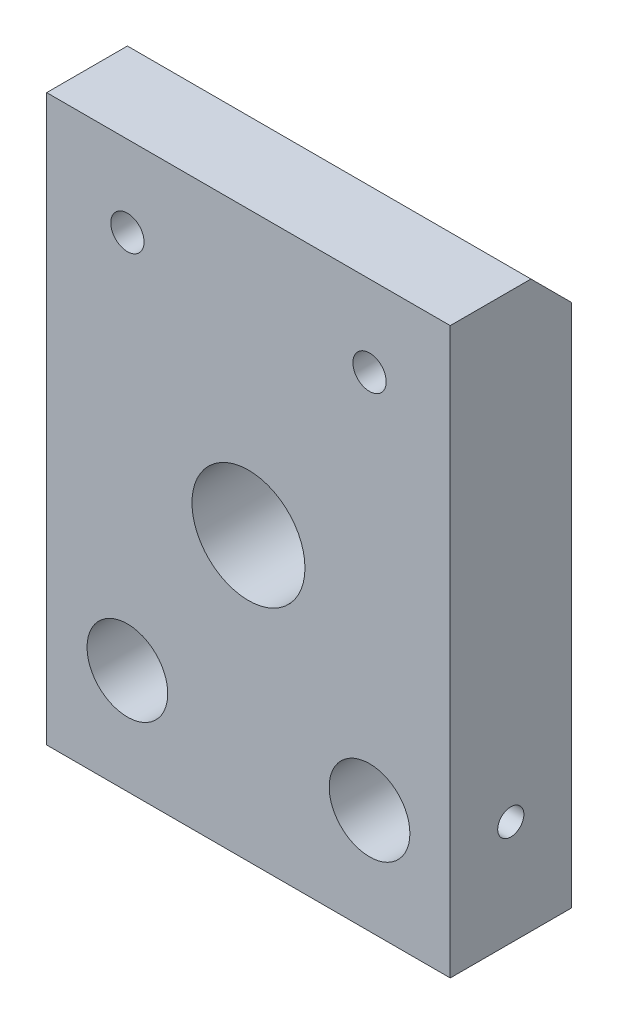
from build123d import *

# Parameters (mm, degrees)
ESQUISSE1_W             = 50
ESQUISSE1_H             = 70
ESQUISSE1_R             = 5
ESQUISSE1_R_2           = 7
ESQUISSE1_R_3           = 2.065
BASE_EXTRUSION_DEPTH    = 15
CHANFREIN3_SIZE         = 5
ENL_V_MAT_EXTRU_1_REACH = 89.321
ESQUISSE10_R            = 1.62


with BuildPart() as part:
    # Esquisse1 → Base-Extrusion (new body)
    with BuildSketch(Plane.XY):
        with Locations((0, 35)):
            Rectangle(ESQUISSE1_W, ESQUISSE1_H)
        with Locations((15, 13)):
            Circle(ESQUISSE1_R, mode=Mode.SUBTRACT)
        with Locations(Location((-15, 13, 0), (0, 0, 180))):
            Circle(ESQUISSE1_R, mode=Mode.SUBTRACT)
        with Locations((0, 35)):
            Circle(ESQUISSE1_R_2, mode=Mode.SUBTRACT)
        with Locations((-15, 60)):
            Circle(ESQUISSE1_R_3, mode=Mode.SUBTRACT)
        with Locations(Location((15, 60, 0), (0, 0, 180))):
            Circle(ESQUISSE1_R_3, mode=Mode.SUBTRACT)
    extrude(amount=BASE_EXTRUSION_DEPTH)

    # Chanfrein3
    chanfrein3_edges = [part.edges().sort_by_distance(p)[0] for p in [
        (0, 70, 0),
    ]]
    chamfer(chanfrein3_edges, length=CHANFREIN3_SIZE)

    # Esquisse10 → Enl_v. mat.-Extru.1 (cut, up to next)
    with BuildSketch(Plane(origin=(25, 0, 0), x_dir=(0, 0, -1), z_dir=(1, 0, 0)), mode=Mode.PRIVATE) as enl_v_mat_extru_1_sk1:
        with Locations((-7.5, 13)):
            Circle(ESQUISSE10_R)
    enl_v_mat_extru_1_tool1 = extrude(enl_v_mat_extru_1_sk1.sketch, amount=-ENL_V_MAT_EXTRU_1_REACH, mode=Mode.PRIVATE) & part.part
    enl_v_mat_extru_1 = enl_v_mat_extru_1_tool1.solids().sort_by_distance((25, 13, 7.5))[0]
    add(enl_v_mat_extru_1, mode=Mode.SUBTRACT)

    # Sym_trie1: Enl_v. mat.-Extru.1 across plane
    add(enl_v_mat_extru_1.mirror(Plane(origin=(0, 0, 0), x_dir=(0, 0, 1), z_dir=(1, 0, 0))), mode=Mode.SUBTRACT)


solid = part.part
